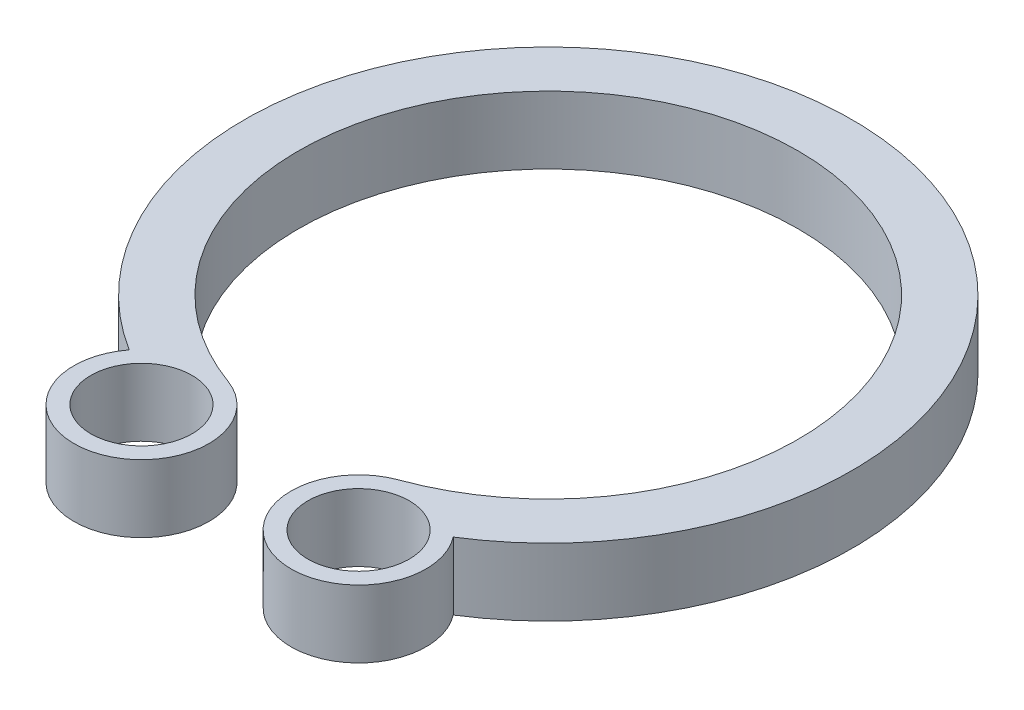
ISO-10303-21;
HEADER;
FILE_DESCRIPTION(('STEP AP214'),'2;1');
FILE_NAME('part.step','',(''),(''),'','','');
FILE_SCHEMA(('AUTOMOTIVE_DESIGN { 1 0 10303 214 1 1 1 1 }'));
ENDSEC;
DATA;
#1=APPLICATION_CONTEXT('core data for automotive mechanical design processes');
#2=APPLICATION_PROTOCOL_DEFINITION('international standard','automotive_design',2000,#1);
#3=PRODUCT_CONTEXT('',#1,'mechanical');
#4=PRODUCT('Part','Part','',(#3));
#5=PRODUCT_RELATED_PRODUCT_CATEGORY('part','',(#4));
#6=PRODUCT_DEFINITION_FORMATION('','',#4);
#7=PRODUCT_DEFINITION_CONTEXT('part definition',#1,'design');
#8=PRODUCT_DEFINITION('design','',#6,#7);
#9=PRODUCT_DEFINITION_SHAPE('','',#8);
#10=(LENGTH_UNIT() NAMED_UNIT(*) SI_UNIT(.MILLI.,.METRE.));
#11=(NAMED_UNIT(*) PLANE_ANGLE_UNIT() SI_UNIT($,.RADIAN.));
#12=(NAMED_UNIT(*) SI_UNIT($,.STERADIAN.) SOLID_ANGLE_UNIT());
#13=UNCERTAINTY_MEASURE_WITH_UNIT(LENGTH_MEASURE(1.E-05),#10,'distance_accuracy_value','');
#14=(GEOMETRIC_REPRESENTATION_CONTEXT(3) GLOBAL_UNCERTAINTY_ASSIGNED_CONTEXT((#13)) GLOBAL_UNIT_ASSIGNED_CONTEXT((#10,
#11,#12)) REPRESENTATION_CONTEXT('',''));
#15=CARTESIAN_POINT('',(0.,0.,0.));
#16=DIRECTION('',(0.,0.,1.));
#17=DIRECTION('',(1.,0.,0.));
#18=AXIS2_PLACEMENT_3D('',#15,#16,#17);
#19=CARTESIAN_POINT('',(-0.803747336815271,1.,2.2082776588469));
#20=DIRECTION('',(0.,1.,0.));
#21=DIRECTION('',(0.,0.,1.));
#22=AXIS2_PLACEMENT_3D('',#19,#20,#21);
#23=PLANE('',#22);
#24=CARTESIAN_POINT('',(-1.60749467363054,1.,4.41655531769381));
#25=DIRECTION('',(0.,1.,0.));
#26=DIRECTION('',(0.,0.,1.));
#27=AXIS2_PLACEMENT_3D('',#24,#25,#26);
#28=CIRCLE('',#27,0.75);
#29=CARTESIAN_POINT('',(-1.60749467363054,1.,5.16655531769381));
#30=VERTEX_POINT('',#29);
#31=EDGE_CURVE('E101',#30,#30,#28,.T.);
#32=ORIENTED_EDGE('',*,*,#31,.F.);
#33=EDGE_LOOP('',(#32));
#34=FACE_BOUND('',#33,.T.);
#35=CARTESIAN_POINT('',(-1.60749467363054,1.,4.41655531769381));
#36=DIRECTION('',(0.,1.,0.));
#37=DIRECTION('',(0.,0.,1.));
#38=AXIS2_PLACEMENT_3D('',#35,#36,#37);
#39=CIRCLE('',#38,0.999999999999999);
#40=CARTESIAN_POINT('',(-2.39993933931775,1.,3.80661150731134));
#41=VERTEX_POINT('',#40);
#42=CARTESIAN_POINT('',(-1.26547453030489,1.,3.47686269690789));
#43=VERTEX_POINT('',#42);
#44=EDGE_CURVE('E86',#41,#43,#39,.T.);
#45=ORIENTED_EDGE('',*,*,#44,.T.);
#46=CARTESIAN_POINT('',(0.,1.,0.));
#47=DIRECTION('',(0.,-1.,0.));
#48=DIRECTION('',(0.,0.,1.));
#49=AXIS2_PLACEMENT_3D('',#46,#47,#48);
#50=CIRCLE('',#49,3.7);
#51=CARTESIAN_POINT('',(1.2654745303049,1.,3.47686269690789));
#52=VERTEX_POINT('',#51);
#53=EDGE_CURVE('E81',#43,#52,#50,.T.);
#54=ORIENTED_EDGE('',*,*,#53,.T.);
#55=CARTESIAN_POINT('',(1.60749467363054,1.,4.41655531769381));
#56=DIRECTION('',(0.,1.,0.));
#57=DIRECTION('',(0.,0.,1.));
#58=AXIS2_PLACEMENT_3D('',#55,#56,#57);
#59=CIRCLE('',#58,1.);
#60=CARTESIAN_POINT('',(2.39993933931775,1.,3.80661150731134));
#61=VERTEX_POINT('',#60);
#62=EDGE_CURVE('E84',#52,#61,#59,.T.);
#63=ORIENTED_EDGE('',*,*,#62,.T.);
#64=CARTESIAN_POINT('',(0.,1.,0.));
#65=DIRECTION('',(0.,1.,0.));
#66=DIRECTION('',(0.,0.,1.));
#67=AXIS2_PLACEMENT_3D('',#64,#65,#66);
#68=CIRCLE('',#67,4.5);
#69=EDGE_CURVE('E51',#61,#41,#68,.T.);
#70=ORIENTED_EDGE('',*,*,#69,.T.);
#71=EDGE_LOOP('',(#45,#54,#63,#70));
#72=FACE_BOUND('',#71,.T.);
#73=CARTESIAN_POINT('',(1.60749467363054,1.,4.41655531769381));
#74=DIRECTION('',(0.,1.,0.));
#75=DIRECTION('',(0.,0.,-1.));
#76=AXIS2_PLACEMENT_3D('',#73,#74,#75);
#77=CIRCLE('',#76,0.75);
#78=CARTESIAN_POINT('',(1.60749467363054,1.,3.66655531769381));
#79=VERTEX_POINT('',#78);
#80=EDGE_CURVE('E116',#79,#79,#77,.T.);
#81=ORIENTED_EDGE('',*,*,#80,.F.);
#82=EDGE_LOOP('',(#81));
#83=FACE_BOUND('',#82,.T.);
#84=ADVANCED_FACE('F34',(#34,#72,#83),#23,.T.);
#85=CARTESIAN_POINT('',(-0.803747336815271,0.,2.2082776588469));
#86=DIRECTION('',(0.,1.,0.));
#87=DIRECTION('',(0.,0.,1.));
#88=AXIS2_PLACEMENT_3D('',#85,#86,#87);
#89=PLANE('',#88);
#90=CARTESIAN_POINT('',(-1.60749467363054,0.,4.41655531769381));
#91=DIRECTION('',(0.,1.,0.));
#92=DIRECTION('',(0.,0.,1.));
#93=AXIS2_PLACEMENT_3D('',#90,#91,#92);
#94=CIRCLE('',#93,0.999999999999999);
#95=CARTESIAN_POINT('',(-2.39993933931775,0.,3.80661150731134));
#96=VERTEX_POINT('',#95);
#97=CARTESIAN_POINT('',(-1.26547453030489,0.,3.47686269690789));
#98=VERTEX_POINT('',#97);
#99=EDGE_CURVE('E98',#96,#98,#94,.T.);
#100=ORIENTED_EDGE('',*,*,#99,.F.);
#101=CARTESIAN_POINT('',(0.,0.,0.));
#102=DIRECTION('',(0.,1.,0.));
#103=DIRECTION('',(0.,0.,1.));
#104=AXIS2_PLACEMENT_3D('',#101,#102,#103);
#105=CIRCLE('',#104,4.5);
#106=CARTESIAN_POINT('',(2.39993933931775,0.,3.80661150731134));
#107=VERTEX_POINT('',#106);
#108=EDGE_CURVE('E74',#107,#96,#105,.T.);
#109=ORIENTED_EDGE('',*,*,#108,.F.);
#110=CARTESIAN_POINT('',(1.60749467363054,0.,4.41655531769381));
#111=DIRECTION('',(0.,1.,0.));
#112=DIRECTION('',(0.,0.,1.));
#113=AXIS2_PLACEMENT_3D('',#110,#111,#112);
#114=CIRCLE('',#113,1.);
#115=CARTESIAN_POINT('',(1.2654745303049,0.,3.47686269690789));
#116=VERTEX_POINT('',#115);
#117=EDGE_CURVE('E68',#116,#107,#114,.T.);
#118=ORIENTED_EDGE('',*,*,#117,.F.);
#119=CARTESIAN_POINT('',(0.,0.,0.));
#120=DIRECTION('',(0.,-1.,0.));
#121=DIRECTION('',(0.,0.,1.));
#122=AXIS2_PLACEMENT_3D('',#119,#120,#121);
#123=CIRCLE('',#122,3.7);
#124=EDGE_CURVE('E90',#98,#116,#123,.T.);
#125=ORIENTED_EDGE('',*,*,#124,.F.);
#126=EDGE_LOOP('',(#100,#109,#118,#125));
#127=FACE_BOUND('',#126,.T.);
#128=CARTESIAN_POINT('',(-1.60749467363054,0.,4.41655531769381));
#129=DIRECTION('',(0.,1.,0.));
#130=DIRECTION('',(0.,0.,1.));
#131=AXIS2_PLACEMENT_3D('',#128,#129,#130);
#132=CIRCLE('',#131,0.75);
#133=CARTESIAN_POINT('',(-1.60749467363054,0.,5.16655531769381));
#134=VERTEX_POINT('',#133);
#135=EDGE_CURVE('E113',#134,#134,#132,.T.);
#136=ORIENTED_EDGE('',*,*,#135,.T.);
#137=EDGE_LOOP('',(#136));
#138=FACE_BOUND('',#137,.T.);
#139=CARTESIAN_POINT('',(1.60749467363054,0.,4.41655531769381));
#140=DIRECTION('',(0.,1.,0.));
#141=DIRECTION('',(0.,0.,-1.));
#142=AXIS2_PLACEMENT_3D('',#139,#140,#141);
#143=CIRCLE('',#142,0.75);
#144=CARTESIAN_POINT('',(1.60749467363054,0.,3.66655531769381));
#145=VERTEX_POINT('',#144);
#146=EDGE_CURVE('E119',#145,#145,#143,.T.);
#147=ORIENTED_EDGE('',*,*,#146,.T.);
#148=EDGE_LOOP('',(#147));
#149=FACE_BOUND('',#148,.T.);
#150=ADVANCED_FACE('F109',(#127,#138,#149),#89,.F.);
#151=CARTESIAN_POINT('',(-1.60749467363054,1.,4.41655531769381));
#152=DIRECTION('',(0.,-1.,0.));
#153=DIRECTION('',(0.,0.,-1.));
#154=AXIS2_PLACEMENT_3D('',#151,#152,#153);
#155=CYLINDRICAL_SURFACE('',#154,0.999999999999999);
#156=ORIENTED_EDGE('',*,*,#99,.T.);
#157=DIRECTION('',(0.,-1.,0.));
#158=VECTOR('',#157,1.);
#159=CARTESIAN_POINT('',(-1.26547453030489,1.,3.47686269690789));
#160=LINE('',#159,#158);
#161=EDGE_CURVE('E11',#43,#98,#160,.T.);
#162=ORIENTED_EDGE('',*,*,#161,.F.);
#163=ORIENTED_EDGE('',*,*,#44,.F.);
#164=DIRECTION('',(0.,-1.,0.));
#165=VECTOR('',#164,1.);
#166=CARTESIAN_POINT('',(-2.39993933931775,1.,3.80661150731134));
#167=LINE('',#166,#165);
#168=EDGE_CURVE('E94',#41,#96,#167,.T.);
#169=ORIENTED_EDGE('',*,*,#168,.T.);
#170=EDGE_LOOP('',(#156,#162,#163,#169));
#171=FACE_BOUND('',#170,.T.);
#172=ADVANCED_FACE('F36',(#171),#155,.T.);
#173=CARTESIAN_POINT('',(0.,1.,0.));
#174=DIRECTION('',(0.,-1.,0.));
#175=DIRECTION('',(0.,0.,-1.));
#176=AXIS2_PLACEMENT_3D('',#173,#174,#175);
#177=CYLINDRICAL_SURFACE('',#176,3.7);
#178=ORIENTED_EDGE('',*,*,#124,.T.);
#179=DIRECTION('',(0.,-1.,0.));
#180=VECTOR('',#179,1.);
#181=CARTESIAN_POINT('',(1.2654745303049,1.,3.47686269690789));
#182=LINE('',#181,#180);
#183=EDGE_CURVE('E43',#52,#116,#182,.T.);
#184=ORIENTED_EDGE('',*,*,#183,.F.);
#185=ORIENTED_EDGE('',*,*,#53,.F.);
#186=ORIENTED_EDGE('',*,*,#161,.T.);
#187=EDGE_LOOP('',(#178,#184,#185,#186));
#188=FACE_BOUND('',#187,.T.);
#189=ADVANCED_FACE('F89',(#188),#177,.F.);
#190=CARTESIAN_POINT('',(1.60749467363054,1.,4.41655531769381));
#191=DIRECTION('',(0.,-1.,0.));
#192=DIRECTION('',(0.,0.,-1.));
#193=AXIS2_PLACEMENT_3D('',#190,#191,#192);
#194=CYLINDRICAL_SURFACE('',#193,1.);
#195=ORIENTED_EDGE('',*,*,#117,.T.);
#196=DIRECTION('',(0.,-1.,0.));
#197=VECTOR('',#196,1.);
#198=CARTESIAN_POINT('',(2.39993933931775,1.,3.80661150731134));
#199=LINE('',#198,#197);
#200=EDGE_CURVE('E91',#61,#107,#199,.T.);
#201=ORIENTED_EDGE('',*,*,#200,.F.);
#202=ORIENTED_EDGE('',*,*,#62,.F.);
#203=ORIENTED_EDGE('',*,*,#183,.T.);
#204=EDGE_LOOP('',(#195,#201,#202,#203));
#205=FACE_BOUND('',#204,.T.);
#206=ADVANCED_FACE('F92',(#205),#194,.T.);
#207=CARTESIAN_POINT('',(0.,1.,0.));
#208=DIRECTION('',(0.,-1.,0.));
#209=DIRECTION('',(0.,0.,-1.));
#210=AXIS2_PLACEMENT_3D('',#207,#208,#209);
#211=CYLINDRICAL_SURFACE('',#210,4.5);
#212=ORIENTED_EDGE('',*,*,#108,.T.);
#213=ORIENTED_EDGE('',*,*,#168,.F.);
#214=ORIENTED_EDGE('',*,*,#69,.F.);
#215=ORIENTED_EDGE('',*,*,#200,.T.);
#216=EDGE_LOOP('',(#212,#213,#214,#215));
#217=FACE_BOUND('',#216,.T.);
#218=ADVANCED_FACE('F106',(#217),#211,.T.);
#219=CARTESIAN_POINT('',(-1.60749467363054,1.,4.41655531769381));
#220=DIRECTION('',(0.,-1.,0.));
#221=DIRECTION('',(0.,0.,-1.));
#222=AXIS2_PLACEMENT_3D('',#219,#220,#221);
#223=CYLINDRICAL_SURFACE('',#222,0.75);
#224=ORIENTED_EDGE('',*,*,#31,.T.);
#225=EDGE_LOOP('',(#224));
#226=FACE_BOUND('',#225,.T.);
#227=ORIENTED_EDGE('',*,*,#135,.F.);
#228=EDGE_LOOP('',(#227));
#229=FACE_BOUND('',#228,.T.);
#230=ADVANCED_FACE('F136',(#226,#229),#223,.F.);
#231=CARTESIAN_POINT('',(1.60749467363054,1.,4.41655531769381));
#232=DIRECTION('',(0.,-1.,0.));
#233=DIRECTION('',(0.,0.,-1.));
#234=AXIS2_PLACEMENT_3D('',#231,#232,#233);
#235=CYLINDRICAL_SURFACE('',#234,0.75);
#236=ORIENTED_EDGE('',*,*,#80,.T.);
#237=EDGE_LOOP('',(#236));
#238=FACE_BOUND('',#237,.T.);
#239=ORIENTED_EDGE('',*,*,#146,.F.);
#240=EDGE_LOOP('',(#239));
#241=FACE_BOUND('',#240,.T.);
#242=ADVANCED_FACE('F125',(#238,#241),#235,.F.);
#243=CLOSED_SHELL('',(#84,#150,#172,#189,#206,#218,#230,#242));
#244=MANIFOLD_SOLID_BREP('B2',#243);
#245=ADVANCED_BREP_SHAPE_REPRESENTATION('',(#18,#244),#14);
#246=SHAPE_DEFINITION_REPRESENTATION(#9,#245);
ENDSEC;
END-ISO-10303-21;
